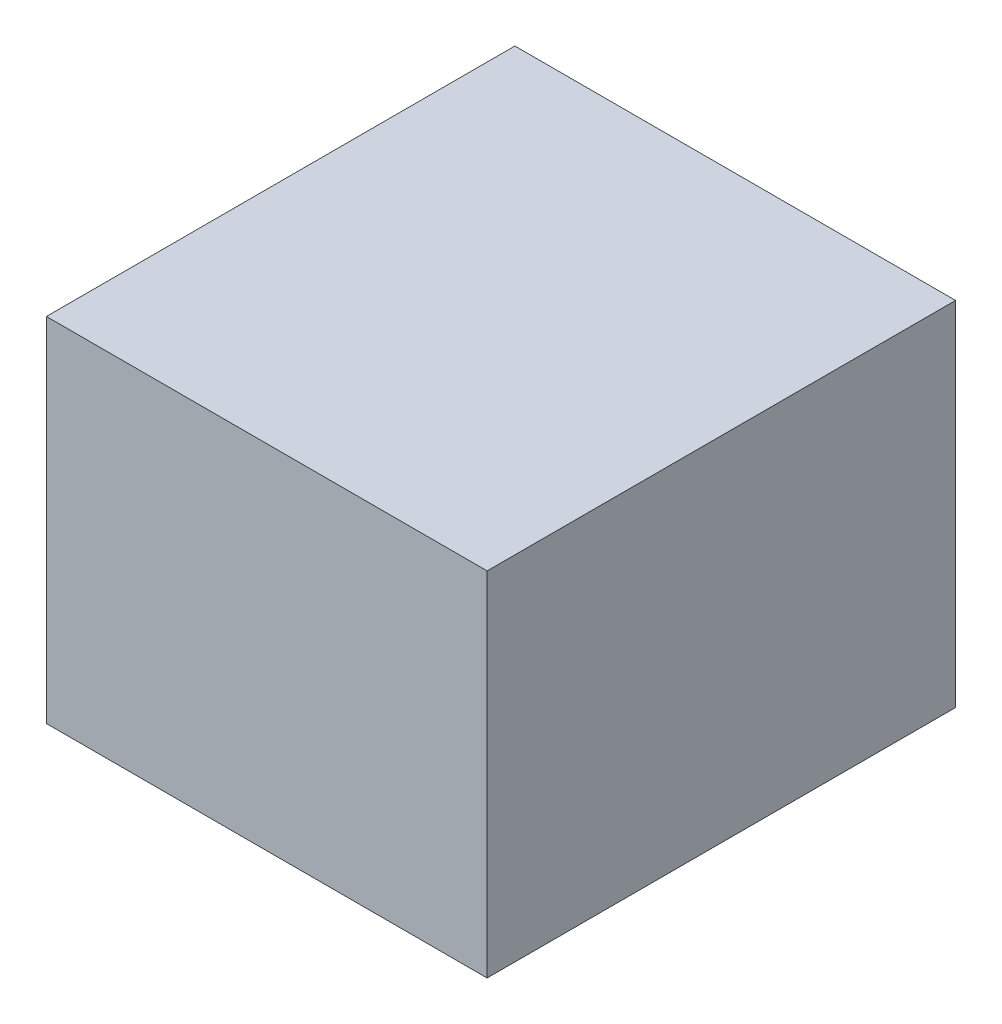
ISO-10303-21;
HEADER;
FILE_DESCRIPTION(('STEP AP214'),'2;1');
FILE_NAME('part.step','',(''),(''),'','','');
FILE_SCHEMA(('AUTOMOTIVE_DESIGN { 1 0 10303 214 1 1 1 1 }'));
ENDSEC;
DATA;
#1=APPLICATION_CONTEXT('core data for automotive mechanical design processes');
#2=APPLICATION_PROTOCOL_DEFINITION('international standard','automotive_design',2000,#1);
#3=PRODUCT_CONTEXT('',#1,'mechanical');
#4=PRODUCT('Part','Part','',(#3));
#5=PRODUCT_RELATED_PRODUCT_CATEGORY('part','',(#4));
#6=PRODUCT_DEFINITION_FORMATION('','',#4);
#7=PRODUCT_DEFINITION_CONTEXT('part definition',#1,'design');
#8=PRODUCT_DEFINITION('design','',#6,#7);
#9=PRODUCT_DEFINITION_SHAPE('','',#8);
#10=(LENGTH_UNIT() NAMED_UNIT(*) SI_UNIT(.MILLI.,.METRE.));
#11=(NAMED_UNIT(*) PLANE_ANGLE_UNIT() SI_UNIT($,.RADIAN.));
#12=(NAMED_UNIT(*) SI_UNIT($,.STERADIAN.) SOLID_ANGLE_UNIT());
#13=UNCERTAINTY_MEASURE_WITH_UNIT(LENGTH_MEASURE(1.E-05),#10,'distance_accuracy_value','');
#14=(GEOMETRIC_REPRESENTATION_CONTEXT(3) GLOBAL_UNCERTAINTY_ASSIGNED_CONTEXT((#13)) GLOBAL_UNIT_ASSIGNED_CONTEXT((#10,
#11,#12)) REPRESENTATION_CONTEXT('',''));
#15=CARTESIAN_POINT('',(0.,0.,0.));
#16=DIRECTION('',(0.,0.,1.));
#17=DIRECTION('',(1.,0.,0.));
#18=AXIS2_PLACEMENT_3D('',#15,#16,#17);
#19=CARTESIAN_POINT('',(0.,0.,2.69999968));
#20=DIRECTION('',(0.,0.,-1.));
#21=DIRECTION('',(0.,-1.,0.));
#22=AXIS2_PLACEMENT_3D('',#19,#20,#21);
#23=PLANE('',#22);
#24=DIRECTION('',(0.,-1.,0.));
#25=VECTOR('',#24,1.);
#26=CARTESIAN_POINT('',(1.27,1.016,2.69999968));
#27=LINE('',#26,#25);
#28=CARTESIAN_POINT('',(1.27,1.016,2.69999968));
#29=VERTEX_POINT('',#28);
#30=CARTESIAN_POINT('',(1.27,-1.016,2.69999968));
#31=VERTEX_POINT('',#30);
#32=EDGE_CURVE('E20',#29,#31,#27,.T.);
#33=ORIENTED_EDGE('',*,*,#32,.F.);
#34=DIRECTION('',(1.,0.,0.));
#35=VECTOR('',#34,1.);
#36=CARTESIAN_POINT('',(-1.27,1.016,2.69999968));
#37=LINE('',#36,#35);
#38=CARTESIAN_POINT('',(-1.27,1.016,2.69999968));
#39=VERTEX_POINT('',#38);
#40=EDGE_CURVE('E108',#39,#29,#37,.T.);
#41=ORIENTED_EDGE('',*,*,#40,.F.);
#42=DIRECTION('',(0.,1.,0.));
#43=VECTOR('',#42,1.);
#44=CARTESIAN_POINT('',(-1.27,-1.016,2.69999968));
#45=LINE('',#44,#43);
#46=CARTESIAN_POINT('',(-1.27,-1.016,2.69999968));
#47=VERTEX_POINT('',#46);
#48=EDGE_CURVE('E84',#47,#39,#45,.T.);
#49=ORIENTED_EDGE('',*,*,#48,.F.);
#50=DIRECTION('',(-1.,0.,0.));
#51=VECTOR('',#50,1.);
#52=CARTESIAN_POINT('',(1.27,-1.016,2.69999968));
#53=LINE('',#52,#51);
#54=EDGE_CURVE('E88',#31,#47,#53,.T.);
#55=ORIENTED_EDGE('',*,*,#54,.F.);
#56=EDGE_LOOP('',(#33,#41,#49,#55));
#57=FACE_BOUND('',#56,.T.);
#58=ADVANCED_FACE('F17',(#57),#23,.F.);
#59=CARTESIAN_POINT('',(0.,0.,0.));
#60=DIRECTION('',(0.,0.,-1.));
#61=DIRECTION('',(0.,-1.,0.));
#62=AXIS2_PLACEMENT_3D('',#59,#60,#61);
#63=PLANE('',#62);
#64=DIRECTION('',(-1.,0.,0.));
#65=VECTOR('',#64,1.);
#66=CARTESIAN_POINT('',(1.27,-1.016,0.));
#67=LINE('',#66,#65);
#68=CARTESIAN_POINT('',(1.27,-1.016,0.));
#69=VERTEX_POINT('',#68);
#70=CARTESIAN_POINT('',(-1.27,-1.016,0.));
#71=VERTEX_POINT('',#70);
#72=EDGE_CURVE('E72',#69,#71,#67,.T.);
#73=ORIENTED_EDGE('',*,*,#72,.T.);
#74=DIRECTION('',(0.,1.,0.));
#75=VECTOR('',#74,1.);
#76=CARTESIAN_POINT('',(-1.27,-1.016,0.));
#77=LINE('',#76,#75);
#78=CARTESIAN_POINT('',(-1.27,1.016,0.));
#79=VERTEX_POINT('',#78);
#80=EDGE_CURVE('E105',#71,#79,#77,.T.);
#81=ORIENTED_EDGE('',*,*,#80,.T.);
#82=DIRECTION('',(1.,0.,0.));
#83=VECTOR('',#82,1.);
#84=CARTESIAN_POINT('',(-1.27,1.016,0.));
#85=LINE('',#84,#83);
#86=CARTESIAN_POINT('',(1.27,1.016,0.));
#87=VERTEX_POINT('',#86);
#88=EDGE_CURVE('E74',#79,#87,#85,.T.);
#89=ORIENTED_EDGE('',*,*,#88,.T.);
#90=DIRECTION('',(0.,-1.,0.));
#91=VECTOR('',#90,1.);
#92=CARTESIAN_POINT('',(1.27,1.016,0.));
#93=LINE('',#92,#91);
#94=EDGE_CURVE('E11',#87,#69,#93,.T.);
#95=ORIENTED_EDGE('',*,*,#94,.T.);
#96=EDGE_LOOP('',(#73,#81,#89,#95));
#97=FACE_BOUND('',#96,.T.);
#98=ADVANCED_FACE('F70',(#97),#63,.T.);
#99=CARTESIAN_POINT('',(1.27,1.016,0.));
#100=DIRECTION('',(1.,0.,0.));
#101=DIRECTION('',(0.,1.,0.));
#102=AXIS2_PLACEMENT_3D('',#99,#100,#101);
#103=PLANE('',#102);
#104=DIRECTION('',(0.,0.,1.));
#105=VECTOR('',#104,1.);
#106=CARTESIAN_POINT('',(1.27,1.016,0.));
#107=LINE('',#106,#105);
#108=EDGE_CURVE('E111',#87,#29,#107,.T.);
#109=ORIENTED_EDGE('',*,*,#108,.T.);
#110=ORIENTED_EDGE('',*,*,#32,.T.);
#111=DIRECTION('',(0.,0.,1.));
#112=VECTOR('',#111,1.);
#113=CARTESIAN_POINT('',(1.27,-1.016,0.));
#114=LINE('',#113,#112);
#115=EDGE_CURVE('E80',#69,#31,#114,.T.);
#116=ORIENTED_EDGE('',*,*,#115,.F.);
#117=ORIENTED_EDGE('',*,*,#94,.F.);
#118=EDGE_LOOP('',(#109,#110,#116,#117));
#119=FACE_BOUND('',#118,.T.);
#120=ADVANCED_FACE('F86',(#119),#103,.T.);
#121=CARTESIAN_POINT('',(-1.27,1.016,0.));
#122=DIRECTION('',(0.,1.,0.));
#123=DIRECTION('',(1.,0.,0.));
#124=AXIS2_PLACEMENT_3D('',#121,#122,#123);
#125=PLANE('',#124);
#126=DIRECTION('',(0.,0.,1.));
#127=VECTOR('',#126,1.);
#128=CARTESIAN_POINT('',(-1.27,1.016,0.));
#129=LINE('',#128,#127);
#130=EDGE_CURVE('E99',#79,#39,#129,.T.);
#131=ORIENTED_EDGE('',*,*,#130,.T.);
#132=ORIENTED_EDGE('',*,*,#40,.T.);
#133=ORIENTED_EDGE('',*,*,#108,.F.);
#134=ORIENTED_EDGE('',*,*,#88,.F.);
#135=EDGE_LOOP('',(#131,#132,#133,#134));
#136=FACE_BOUND('',#135,.T.);
#137=ADVANCED_FACE('F118',(#136),#125,.T.);
#138=CARTESIAN_POINT('',(-1.27,-1.016,0.));
#139=DIRECTION('',(-1.,0.,0.));
#140=DIRECTION('',(0.,0.,1.));
#141=AXIS2_PLACEMENT_3D('',#138,#139,#140);
#142=PLANE('',#141);
#143=DIRECTION('',(0.,0.,1.));
#144=VECTOR('',#143,1.);
#145=CARTESIAN_POINT('',(-1.27,-1.016,0.));
#146=LINE('',#145,#144);
#147=EDGE_CURVE('E82',#71,#47,#146,.T.);
#148=ORIENTED_EDGE('',*,*,#147,.T.);
#149=ORIENTED_EDGE('',*,*,#48,.T.);
#150=ORIENTED_EDGE('',*,*,#130,.F.);
#151=ORIENTED_EDGE('',*,*,#80,.F.);
#152=EDGE_LOOP('',(#148,#149,#150,#151));
#153=FACE_BOUND('',#152,.T.);
#154=ADVANCED_FACE('F121',(#153),#142,.T.);
#155=CARTESIAN_POINT('',(1.27,-1.016,0.));
#156=DIRECTION('',(0.,-1.,0.));
#157=DIRECTION('',(0.,0.,-1.));
#158=AXIS2_PLACEMENT_3D('',#155,#156,#157);
#159=PLANE('',#158);
#160=ORIENTED_EDGE('',*,*,#115,.T.);
#161=ORIENTED_EDGE('',*,*,#54,.T.);
#162=ORIENTED_EDGE('',*,*,#147,.F.);
#163=ORIENTED_EDGE('',*,*,#72,.F.);
#164=EDGE_LOOP('',(#160,#161,#162,#163));
#165=FACE_BOUND('',#164,.T.);
#166=ADVANCED_FACE('F78',(#165),#159,.T.);
#167=CLOSED_SHELL('',(#58,#98,#120,#137,#154,#166));
#168=MANIFOLD_SOLID_BREP('B1',#167);
#169=ADVANCED_BREP_SHAPE_REPRESENTATION('',(#18,#168),#14);
#170=SHAPE_DEFINITION_REPRESENTATION(#9,#169);
ENDSEC;
END-ISO-10303-21;
